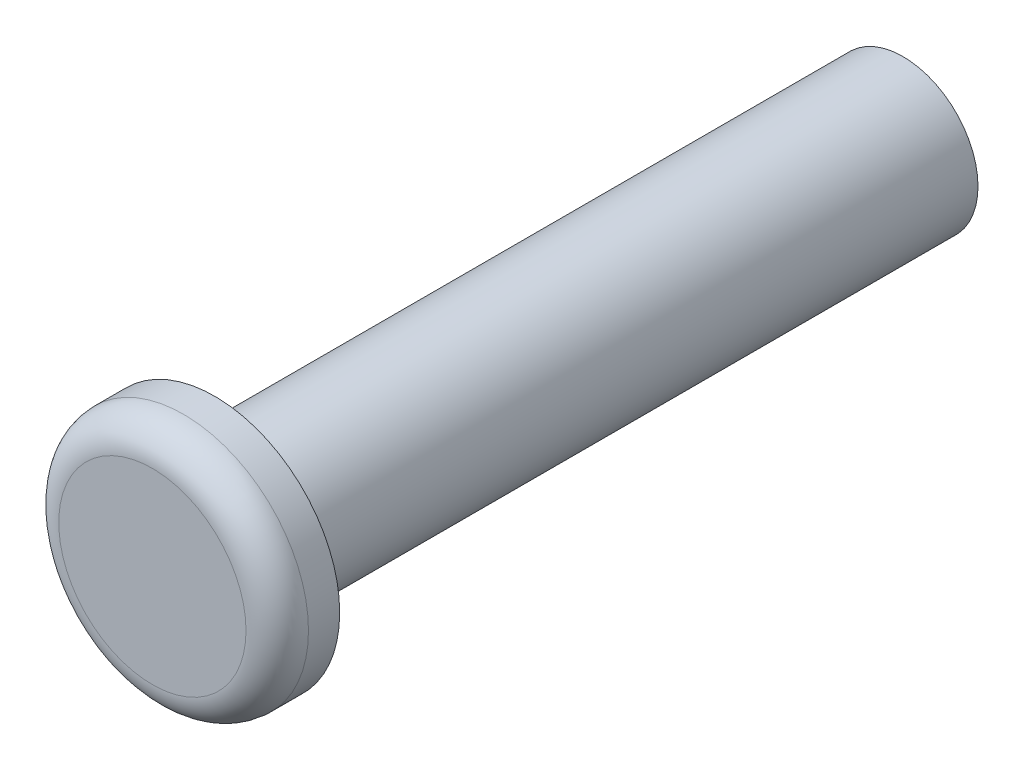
from build123d import *

# Parameters (mm, degrees)
SKETCH1_R           = 3.81
BASE_EXTRUDE_DEPTH  = 35
SKETCH2_R           = 6.35
BOSS_EXTRUDE1_DEPTH = 3.175
FILLET1_R           = 1.5875


with BuildPart() as part:
    # Sketch1 → Base-Extrude (new body)
    with BuildSketch(Plane.XY):
        Circle(SKETCH1_R)
    extrude(amount=-BASE_EXTRUDE_DEPTH)

    # Sketch2 → Boss-Extrude1 (add)
    with BuildSketch(Plane.XY):
        Circle(SKETCH2_R)
    extrude(amount=BOSS_EXTRUDE1_DEPTH)

    # Fillet1
    fillet1_edges = [part.edges().sort_by_distance(p)[0] for p in [
        (-6.35, 0, 3.175),
    ]]
    fillet(fillet1_edges, radius=FILLET1_R)


solid = part.part
